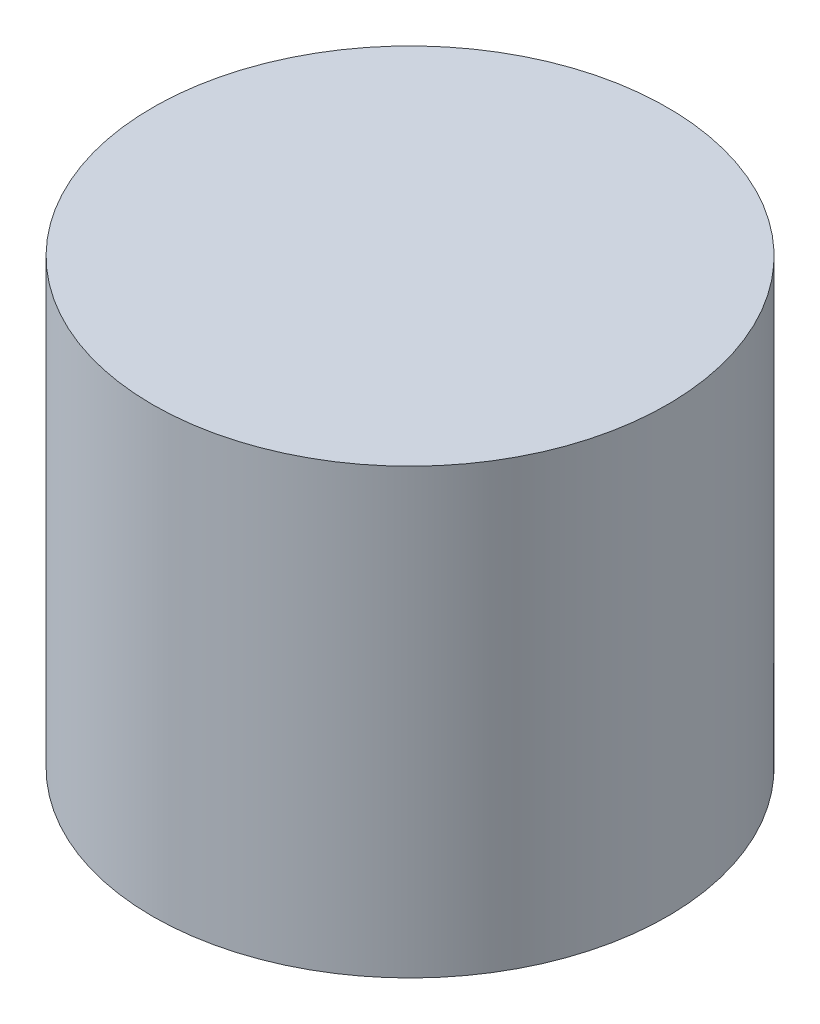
ISO-10303-21;
HEADER;
FILE_DESCRIPTION(('STEP AP214'),'2;1');
FILE_NAME('part.step','',(''),(''),'','','');
FILE_SCHEMA(('AUTOMOTIVE_DESIGN { 1 0 10303 214 1 1 1 1 }'));
ENDSEC;
DATA;
#1=APPLICATION_CONTEXT('core data for automotive mechanical design processes');
#2=APPLICATION_PROTOCOL_DEFINITION('international standard','automotive_design',2000,#1);
#3=PRODUCT_CONTEXT('',#1,'mechanical');
#4=PRODUCT('Part','Part','',(#3));
#5=PRODUCT_RELATED_PRODUCT_CATEGORY('part','',(#4));
#6=PRODUCT_DEFINITION_FORMATION('','',#4);
#7=PRODUCT_DEFINITION_CONTEXT('part definition',#1,'design');
#8=PRODUCT_DEFINITION('design','',#6,#7);
#9=PRODUCT_DEFINITION_SHAPE('','',#8);
#10=(LENGTH_UNIT() NAMED_UNIT(*) SI_UNIT(.MILLI.,.METRE.));
#11=(NAMED_UNIT(*) PLANE_ANGLE_UNIT() SI_UNIT($,.RADIAN.));
#12=(NAMED_UNIT(*) SI_UNIT($,.STERADIAN.) SOLID_ANGLE_UNIT());
#13=UNCERTAINTY_MEASURE_WITH_UNIT(LENGTH_MEASURE(1.E-05),#10,'distance_accuracy_value','');
#14=(GEOMETRIC_REPRESENTATION_CONTEXT(3) GLOBAL_UNCERTAINTY_ASSIGNED_CONTEXT((#13)) GLOBAL_UNIT_ASSIGNED_CONTEXT((#10,
#11,#12)) REPRESENTATION_CONTEXT('',''));
#15=CARTESIAN_POINT('',(0.,0.,0.));
#16=DIRECTION('',(0.,0.,1.));
#17=DIRECTION('',(1.,0.,0.));
#18=AXIS2_PLACEMENT_3D('',#15,#16,#17);
#19=CARTESIAN_POINT('',(0.,27.55,0.));
#20=DIRECTION('',(0.,-1.,0.));
#21=DIRECTION('',(0.,0.,-1.));
#22=AXIS2_PLACEMENT_3D('',#19,#20,#21);
#23=CYLINDRICAL_SURFACE('',#22,16.);
#24=CARTESIAN_POINT('',(0.,27.55,0.));
#25=DIRECTION('',(0.,1.,0.));
#26=DIRECTION('',(0.,0.,1.));
#27=AXIS2_PLACEMENT_3D('',#24,#25,#26);
#28=CIRCLE('',#27,16.);
#29=CARTESIAN_POINT('',(0.,27.55,16.));
#30=VERTEX_POINT('',#29);
#31=EDGE_CURVE('E10',#30,#30,#28,.T.);
#32=ORIENTED_EDGE('',*,*,#31,.F.);
#33=EDGE_LOOP('',(#32));
#34=FACE_BOUND('',#33,.T.);
#35=CARTESIAN_POINT('',(0.,0.,0.));
#36=DIRECTION('',(0.,1.,0.));
#37=DIRECTION('',(0.,0.,1.));
#38=AXIS2_PLACEMENT_3D('',#35,#36,#37);
#39=CIRCLE('',#38,16.);
#40=CARTESIAN_POINT('',(0.,0.,16.));
#41=VERTEX_POINT('',#40);
#42=EDGE_CURVE('E46',#41,#41,#39,.T.);
#43=ORIENTED_EDGE('',*,*,#42,.T.);
#44=EDGE_LOOP('',(#43));
#45=FACE_BOUND('',#44,.T.);
#46=ADVANCED_FACE('F43',(#34,#45),#23,.T.);
#47=CARTESIAN_POINT('',(0.,27.55,0.));
#48=DIRECTION('',(0.,1.,0.));
#49=DIRECTION('',(0.,0.,1.));
#50=AXIS2_PLACEMENT_3D('',#47,#48,#49);
#51=PLANE('',#50);
#52=ORIENTED_EDGE('',*,*,#31,.T.);
#53=EDGE_LOOP('',(#52));
#54=FACE_BOUND('',#53,.T.);
#55=ADVANCED_FACE('F60',(#54),#51,.T.);
#56=CARTESIAN_POINT('',(0.,0.,0.));
#57=DIRECTION('',(0.,1.,0.));
#58=DIRECTION('',(0.,0.,1.));
#59=AXIS2_PLACEMENT_3D('',#56,#57,#58);
#60=PLANE('',#59);
#61=ORIENTED_EDGE('',*,*,#42,.F.);
#62=EDGE_LOOP('',(#61));
#63=FACE_BOUND('',#62,.T.);
#64=ADVANCED_FACE('F58',(#63),#60,.F.);
#65=CLOSED_SHELL('',(#46,#55,#64));
#66=MANIFOLD_SOLID_BREP('B2',#65);
#67=ADVANCED_BREP_SHAPE_REPRESENTATION('',(#18,#66),#14);
#68=SHAPE_DEFINITION_REPRESENTATION(#9,#67);
ENDSEC;
END-ISO-10303-21;
